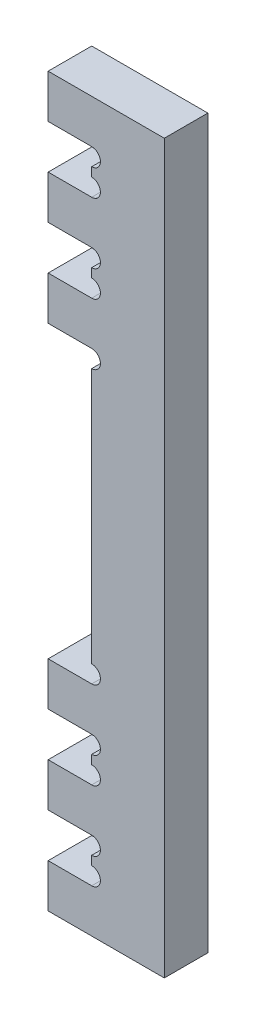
from build123d import *

# Parameters (mm, degrees)
AUFSATZ_LINEAR_AUSTRAGEN1_DEPTH = 15


with BuildPart() as part:
    # Skizze1 → Aufsatz-Linear austragen1 (new body)
    with BuildSketch(Plane.XY):
        with BuildLine():
            Line((0, 0), (0, 15))
            Line((0, 15), (15, 15))
            ThreePointArc((15, 15), (18, 18), (15, 21))
            Line((15, 21), (15, 24.1))
            ThreePointArc((15, 24.1), (18, 27.1), (15, 30.1))
            Line((15, 30.1), (0, 30.1))
            Line((0, 30.1), (0, 45.1))
            Line((0, 45.1), (15, 45.1))
            ThreePointArc((15, 45.1), (18, 48.1), (15, 51.1))
            Line((15, 51.1), (15, 54.2))
            ThreePointArc((15, 54.2), (18, 57.2), (15, 60.2))
            Line((15, 60.2), (0, 60.2))
            Line((0, 60.2), (0, 75.2))
            Line((0, 75.2), (15, 75.2))
            ThreePointArc((15, 75.2), (18, 78.2), (15, 81.2))
            Line((15, 81.2), (15, 169.25))
            ThreePointArc((15, 169.25), (18, 172.25), (15, 175.25))
            Line((15, 175.25), (0, 175.25))
            Line((0, 175.25), (0, 190.25))
            Line((0, 190.25), (15, 190.25))
            ThreePointArc((15, 190.25), (18, 193.25), (15, 196.25))
            Line((15, 196.25), (15, 199.35))
            ThreePointArc((15, 199.35), (18, 202.35), (15, 205.35))
            Line((15, 205.35), (0, 205.35))
            Line((0, 205.35), (0, 220.35))
            Line((0, 220.35), (15, 220.35))
            ThreePointArc((15, 220.35), (18, 223.35), (15, 226.35))
            Line((15, 226.35), (15, 229.45))
            ThreePointArc((15, 229.45), (18, 232.45), (15, 235.45))
            Line((15, 235.45), (0, 235.45))
            Line((0, 235.45), (0, 250.45))
            Line((0, 250.45), (40, 250.45))
            Line((40, 250.45), (40, 0))
            Line((40, 0), (0, 0))
        make_face()
    extrude(amount=AUFSATZ_LINEAR_AUSTRAGEN1_DEPTH)


solid = part.part
